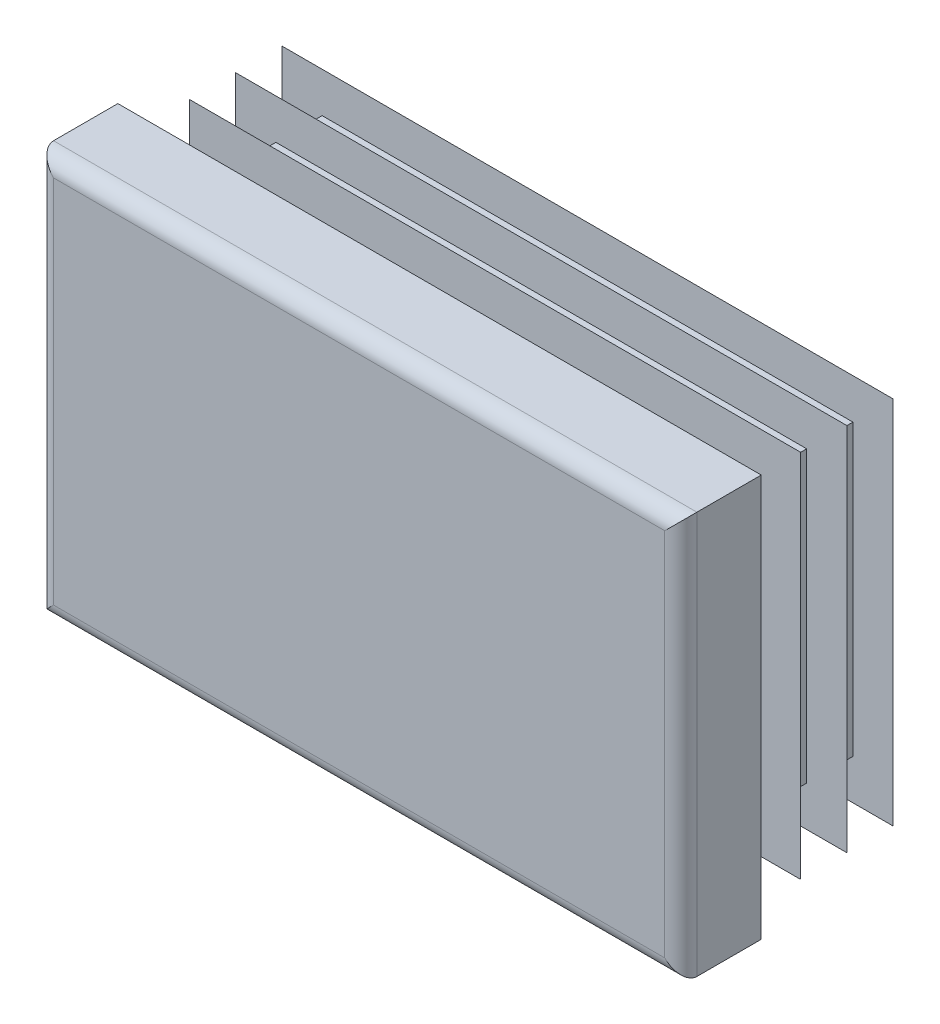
ISO-10303-21;
HEADER;
FILE_DESCRIPTION(('STEP AP214'),'2;1');
FILE_NAME('part.step','',(''),(''),'','','');
FILE_SCHEMA(('AUTOMOTIVE_DESIGN { 1 0 10303 214 1 1 1 1 }'));
ENDSEC;
DATA;
#1=APPLICATION_CONTEXT('core data for automotive mechanical design processes');
#2=APPLICATION_PROTOCOL_DEFINITION('international standard','automotive_design',2000,#1);
#3=PRODUCT_CONTEXT('',#1,'mechanical');
#4=PRODUCT('Part','Part','',(#3));
#5=PRODUCT_RELATED_PRODUCT_CATEGORY('part','',(#4));
#6=PRODUCT_DEFINITION_FORMATION('','',#4);
#7=PRODUCT_DEFINITION_CONTEXT('part definition',#1,'design');
#8=PRODUCT_DEFINITION('design','',#6,#7);
#9=PRODUCT_DEFINITION_SHAPE('','',#8);
#10=(LENGTH_UNIT() NAMED_UNIT(*) SI_UNIT(.MILLI.,.METRE.));
#11=(NAMED_UNIT(*) PLANE_ANGLE_UNIT() SI_UNIT($,.RADIAN.));
#12=(NAMED_UNIT(*) SI_UNIT($,.STERADIAN.) SOLID_ANGLE_UNIT());
#13=UNCERTAINTY_MEASURE_WITH_UNIT(LENGTH_MEASURE(1.E-05),#10,'distance_accuracy_value','');
#14=(GEOMETRIC_REPRESENTATION_CONTEXT(3) GLOBAL_UNCERTAINTY_ASSIGNED_CONTEXT((#13)) GLOBAL_UNIT_ASSIGNED_CONTEXT((#10,
#11,#12)) REPRESENTATION_CONTEXT('',''));
#15=CARTESIAN_POINT('',(0.,0.,0.));
#16=DIRECTION('',(0.,0.,1.));
#17=DIRECTION('',(1.,0.,0.));
#18=AXIS2_PLACEMENT_3D('',#15,#16,#17);
#19=CARTESIAN_POINT('',(19.,-12.5,5.));
#20=DIRECTION('',(0.,0.,-1.));
#21=DIRECTION('',(0.,1.,0.));
#22=AXIS2_PLACEMENT_3D('',#19,#20,#21);
#23=PLANE('',#22);
#24=DIRECTION('',(0.,1.,0.));
#25=VECTOR('',#24,1.);
#26=CARTESIAN_POINT('',(-19.,-12.5,5.));
#27=LINE('',#26,#25);
#28=CARTESIAN_POINT('',(-19.,-11.5,5.));
#29=VERTEX_POINT('',#28);
#30=CARTESIAN_POINT('',(-19.,11.5,5.));
#31=VERTEX_POINT('',#30);
#32=EDGE_CURVE('E310',#29,#31,#27,.T.);
#33=ORIENTED_EDGE('',*,*,#32,.F.);
#34=DIRECTION('',(-1.,0.,0.));
#35=VECTOR('',#34,1.);
#36=CARTESIAN_POINT('',(20.,-11.5,5.));
#37=LINE('',#36,#35);
#38=CARTESIAN_POINT('',(19.,-11.5,5.));
#39=VERTEX_POINT('',#38);
#40=EDGE_CURVE('E482',#39,#29,#37,.T.);
#41=ORIENTED_EDGE('',*,*,#40,.F.);
#42=DIRECTION('',(0.,1.,0.));
#43=VECTOR('',#42,1.);
#44=CARTESIAN_POINT('',(19.,-12.5,5.));
#45=LINE('',#44,#43);
#46=CARTESIAN_POINT('',(19.,11.5,5.));
#47=VERTEX_POINT('',#46);
#48=EDGE_CURVE('E305',#39,#47,#45,.T.);
#49=ORIENTED_EDGE('',*,*,#48,.T.);
#50=DIRECTION('',(-1.,0.,0.));
#51=VECTOR('',#50,1.);
#52=CARTESIAN_POINT('',(20.,11.5,5.));
#53=LINE('',#52,#51);
#54=EDGE_CURVE('E630',#47,#31,#53,.T.);
#55=ORIENTED_EDGE('',*,*,#54,.T.);
#56=EDGE_LOOP('',(#33,#41,#49,#55));
#57=FACE_BOUND('',#56,.T.);
#58=ADVANCED_FACE('F14',(#57),#23,.F.);
#59=CARTESIAN_POINT('',(-19.,-12.5,4.));
#60=DIRECTION('',(0.,1.,0.));
#61=DIRECTION('',(-1.,0.,0.));
#62=AXIS2_PLACEMENT_3D('',#59,#60,#61);
#63=CYLINDRICAL_SURFACE('',#62,1.);
#64=DIRECTION('',(0.,1.,0.));
#65=VECTOR('',#64,1.);
#66=CARTESIAN_POINT('',(-20.,-12.5,4.));
#67=LINE('',#66,#65);
#68=CARTESIAN_POINT('',(-20.,-12.5,4.));
#69=VERTEX_POINT('',#68);
#70=CARTESIAN_POINT('',(-20.,12.5,4.));
#71=VERTEX_POINT('',#70);
#72=EDGE_CURVE('E402',#69,#71,#67,.T.);
#73=ORIENTED_EDGE('',*,*,#72,.F.);
#74=CARTESIAN_POINT('',(-19.,-11.5,4.));
#75=DIRECTION('',(-0.707106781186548,0.707106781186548,0.));
#76=DIRECTION('',(0.707106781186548,0.707106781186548,0.));
#77=AXIS2_PLACEMENT_3D('',#74,#75,#76);
#78=ELLIPSE('',#77,1.41421356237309,1.);
#79=EDGE_CURVE('E59',#69,#29,#78,.T.);
#80=ORIENTED_EDGE('',*,*,#79,.T.);
#81=ORIENTED_EDGE('',*,*,#32,.T.);
#82=CARTESIAN_POINT('',(-19.,11.5,4.));
#83=DIRECTION('',(0.707106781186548,0.707106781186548,0.));
#84=DIRECTION('',(-0.707106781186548,0.707106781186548,0.));
#85=AXIS2_PLACEMENT_3D('',#82,#83,#84);
#86=ELLIPSE('',#85,1.4142135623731,1.);
#87=EDGE_CURVE('E306',#31,#71,#86,.F.);
#88=ORIENTED_EDGE('',*,*,#87,.T.);
#89=EDGE_LOOP('',(#73,#80,#81,#88));
#90=FACE_BOUND('',#89,.T.);
#91=ADVANCED_FACE('F16',(#90),#63,.T.);
#92=CARTESIAN_POINT('',(-20.,-12.5,4.));
#93=DIRECTION('',(1.,0.,0.));
#94=DIRECTION('',(0.,1.,0.));
#95=AXIS2_PLACEMENT_3D('',#92,#93,#94);
#96=PLANE('',#95);
#97=DIRECTION('',(0.,0.,-1.));
#98=VECTOR('',#97,1.);
#99=CARTESIAN_POINT('',(-20.,12.5,4.));
#100=LINE('',#99,#98);
#101=CARTESIAN_POINT('',(-20.,12.5,0.));
#102=VERTEX_POINT('',#101);
#103=EDGE_CURVE('E615',#71,#102,#100,.T.);
#104=ORIENTED_EDGE('',*,*,#103,.T.);
#105=DIRECTION('',(0.,1.,0.));
#106=VECTOR('',#105,1.);
#107=CARTESIAN_POINT('',(-20.,-12.5,0.));
#108=LINE('',#107,#106);
#109=CARTESIAN_POINT('',(-20.,-12.5,0.));
#110=VERTEX_POINT('',#109);
#111=EDGE_CURVE('E400',#110,#102,#108,.T.);
#112=ORIENTED_EDGE('',*,*,#111,.F.);
#113=DIRECTION('',(0.,0.,-1.));
#114=VECTOR('',#113,1.);
#115=CARTESIAN_POINT('',(-20.,-12.5,4.));
#116=LINE('',#115,#114);
#117=EDGE_CURVE('E616',#69,#110,#116,.T.);
#118=ORIENTED_EDGE('',*,*,#117,.F.);
#119=ORIENTED_EDGE('',*,*,#72,.T.);
#120=EDGE_LOOP('',(#104,#112,#118,#119));
#121=FACE_BOUND('',#120,.T.);
#122=ADVANCED_FACE('F697',(#121),#96,.F.);
#123=CARTESIAN_POINT('',(-16.5,-12.5,0.));
#124=DIRECTION('',(1.,0.,0.));
#125=DIRECTION('',(0.,1.,0.));
#126=AXIS2_PLACEMENT_3D('',#123,#124,#125);
#127=PLANE('',#126);
#128=DIRECTION('',(0.,1.,0.));
#129=VECTOR('',#128,1.);
#130=CARTESIAN_POINT('',(-16.5,-12.5,0.));
#131=LINE('',#130,#129);
#132=CARTESIAN_POINT('',(-16.5,-9.,0.));
#133=VERTEX_POINT('',#132);
#134=CARTESIAN_POINT('',(-16.5,9.,0.));
#135=VERTEX_POINT('',#134);
#136=EDGE_CURVE('E397',#133,#135,#131,.T.);
#137=ORIENTED_EDGE('',*,*,#136,.T.);
#138=DIRECTION('',(0.,0.,-1.));
#139=VECTOR('',#138,1.);
#140=CARTESIAN_POINT('',(-16.5,9.,0.));
#141=LINE('',#140,#139);
#142=CARTESIAN_POINT('',(-16.5,9.,-0.575));
#143=VERTEX_POINT('',#142);
#144=EDGE_CURVE('E495',#135,#143,#141,.T.);
#145=ORIENTED_EDGE('',*,*,#144,.T.);
#146=DIRECTION('',(0.,1.,0.));
#147=VECTOR('',#146,1.);
#148=CARTESIAN_POINT('',(-16.5,-12.5,-0.575));
#149=LINE('',#148,#147);
#150=CARTESIAN_POINT('',(-16.5,-9.,-0.575));
#151=VERTEX_POINT('',#150);
#152=EDGE_CURVE('E394',#151,#143,#149,.T.);
#153=ORIENTED_EDGE('',*,*,#152,.F.);
#154=DIRECTION('',(0.,0.,1.));
#155=VECTOR('',#154,1.);
#156=CARTESIAN_POINT('',(-16.5,-9.,0.));
#157=LINE('',#156,#155);
#158=EDGE_CURVE('E489',#151,#133,#157,.T.);
#159=ORIENTED_EDGE('',*,*,#158,.T.);
#160=EDGE_LOOP('',(#137,#145,#153,#159));
#161=FACE_BOUND('',#160,.T.);
#162=ADVANCED_FACE('F787',(#161),#127,.F.);
#163=CARTESIAN_POINT('',(-19.,-12.5,-0.575));
#164=DIRECTION('',(0.342020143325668,0.,0.939692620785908));
#165=DIRECTION('',(-0.939692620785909,0.,0.342020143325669));
#166=AXIS2_PLACEMENT_3D('',#163,#164,#165);
#167=PLANE('',#166);
#168=DIRECTION('',(0.,1.,0.));
#169=VECTOR('',#168,1.);
#170=CARTESIAN_POINT('',(-19.,-12.5,-0.575));
#171=LINE('',#170,#169);
#172=CARTESIAN_POINT('',(-19.,-11.5,-0.575));
#173=VERTEX_POINT('',#172);
#174=CARTESIAN_POINT('',(-19.,11.5,-0.575));
#175=VERTEX_POINT('',#174);
#176=EDGE_CURVE('E392',#173,#175,#171,.T.);
#177=ORIENTED_EDGE('',*,*,#176,.T.);
#178=DIRECTION('',(0.844349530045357,-0.438895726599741,-0.307318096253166));
#179=VECTOR('',#178,1.);
#180=CARTESIAN_POINT('',(-10.1060463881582,6.87689298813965,-3.81213437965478));
#181=LINE('',#180,#179);
#182=CARTESIAN_POINT('',(-16.5,10.2004915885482,-1.48492558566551));
#183=VERTEX_POINT('',#182);
#184=EDGE_CURVE('E519',#175,#183,#181,.T.);
#185=ORIENTED_EDGE('',*,*,#184,.T.);
#186=DIRECTION('',(0.,1.,0.));
#187=VECTOR('',#186,1.);
#188=CARTESIAN_POINT('',(-16.5,-12.5,-1.48492558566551));
#189=LINE('',#188,#187);
#190=CARTESIAN_POINT('',(-16.5,-10.2004915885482,-1.48492558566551));
#191=VERTEX_POINT('',#190);
#192=EDGE_CURVE('E389',#191,#183,#189,.T.);
#193=ORIENTED_EDGE('',*,*,#192,.F.);
#194=DIRECTION('',(-0.844349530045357,-0.43889572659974,0.307318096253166));
#195=VECTOR('',#194,1.);
#196=CARTESIAN_POINT('',(-19.3705814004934,-11.6926294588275,-0.440119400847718));
#197=LINE('',#196,#195);
#198=EDGE_CURVE('E507',#191,#173,#197,.T.);
#199=ORIENTED_EDGE('',*,*,#198,.T.);
#200=EDGE_LOOP('',(#177,#185,#193,#199));
#201=FACE_BOUND('',#200,.T.);
#202=ADVANCED_FACE('F783',(#201),#167,.F.);
#203=CARTESIAN_POINT('',(-16.5,-12.5,-1.48492558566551));
#204=DIRECTION('',(1.,0.,0.));
#205=DIRECTION('',(0.,1.,0.));
#206=AXIS2_PLACEMENT_3D('',#203,#204,#205);
#207=PLANE('',#206);
#208=ORIENTED_EDGE('',*,*,#192,.T.);
#209=DIRECTION('',(0.,-0.819152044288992,-0.573576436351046));
#210=VECTOR('',#209,1.);
#211=CARTESIAN_POINT('',(-16.5,-5.03176689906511,-12.1506678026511));
#212=LINE('',#211,#210);
#213=CARTESIAN_POINT('',(-16.5,9.,-2.32551884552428));
#214=VERTEX_POINT('',#213);
#215=EDGE_CURVE('E516',#183,#214,#212,.T.);
#216=ORIENTED_EDGE('',*,*,#215,.T.);
#217=DIRECTION('',(0.,0.,-1.));
#218=VECTOR('',#217,1.);
#219=CARTESIAN_POINT('',(-16.5,9.,-1.48492558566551));
#220=LINE('',#219,#218);
#221=CARTESIAN_POINT('',(-16.5,9.,-3.45));
#222=VERTEX_POINT('',#221);
#223=EDGE_CURVE('E525',#214,#222,#220,.T.);
#224=ORIENTED_EDGE('',*,*,#223,.T.);
#225=DIRECTION('',(0.,1.,0.));
#226=VECTOR('',#225,1.);
#227=CARTESIAN_POINT('',(-16.5,-12.5,-3.45));
#228=LINE('',#227,#226);
#229=CARTESIAN_POINT('',(-16.5,-9.,-3.45));
#230=VERTEX_POINT('',#229);
#231=EDGE_CURVE('E386',#230,#222,#228,.T.);
#232=ORIENTED_EDGE('',*,*,#231,.F.);
#233=DIRECTION('',(0.,0.,1.));
#234=VECTOR('',#233,1.);
#235=CARTESIAN_POINT('',(-16.5,-9.,-1.48492558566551));
#236=LINE('',#235,#234);
#237=CARTESIAN_POINT('',(-16.5,-9.,-2.32551884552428));
#238=VERTEX_POINT('',#237);
#239=EDGE_CURVE('E522',#230,#238,#236,.T.);
#240=ORIENTED_EDGE('',*,*,#239,.T.);
#241=DIRECTION('',(0.,-0.819152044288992,0.573576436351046));
#242=VECTOR('',#241,1.);
#243=CARTESIAN_POINT('',(-16.5,-11.7434848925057,-0.404510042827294));
#244=LINE('',#243,#242);
#245=EDGE_CURVE('E504',#238,#191,#244,.T.);
#246=ORIENTED_EDGE('',*,*,#245,.T.);
#247=EDGE_LOOP('',(#208,#216,#224,#232,#240,#246));
#248=FACE_BOUND('',#247,.T.);
#249=ADVANCED_FACE('F779',(#248),#207,.F.);
#250=CARTESIAN_POINT('',(-19.,-12.5,-3.45));
#251=DIRECTION('',(0.342020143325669,0.,0.939692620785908));
#252=DIRECTION('',(-0.939692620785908,0.,0.342020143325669));
#253=AXIS2_PLACEMENT_3D('',#250,#251,#252);
#254=PLANE('',#253);
#255=DIRECTION('',(0.,1.,0.));
#256=VECTOR('',#255,1.);
#257=CARTESIAN_POINT('',(-19.,-12.5,-3.45));
#258=LINE('',#257,#256);
#259=CARTESIAN_POINT('',(-19.,-11.5,-3.45));
#260=VERTEX_POINT('',#259);
#261=CARTESIAN_POINT('',(-19.,11.5,-3.45));
#262=VERTEX_POINT('',#261);
#263=EDGE_CURVE('E384',#260,#262,#258,.T.);
#264=ORIENTED_EDGE('',*,*,#263,.T.);
#265=DIRECTION('',(0.844349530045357,-0.438895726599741,-0.307318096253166));
#266=VECTOR('',#265,1.);
#267=CARTESIAN_POINT('',(-10.1060463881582,6.87689298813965,-6.68713437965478));
#268=LINE('',#267,#266);
#269=CARTESIAN_POINT('',(-16.5,10.2004915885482,-4.35992558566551));
#270=VERTEX_POINT('',#269);
#271=EDGE_CURVE('E549',#262,#270,#268,.T.);
#272=ORIENTED_EDGE('',*,*,#271,.T.);
#273=DIRECTION('',(0.,1.,0.));
#274=VECTOR('',#273,1.);
#275=CARTESIAN_POINT('',(-16.5,-12.5,-4.35992558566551));
#276=LINE('',#275,#274);
#277=CARTESIAN_POINT('',(-16.5,-10.2004915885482,-4.35992558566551));
#278=VERTEX_POINT('',#277);
#279=EDGE_CURVE('E381',#278,#270,#276,.T.);
#280=ORIENTED_EDGE('',*,*,#279,.F.);
#281=DIRECTION('',(-0.844349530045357,-0.43889572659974,0.307318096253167));
#282=VECTOR('',#281,1.);
#283=CARTESIAN_POINT('',(-19.3705814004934,-11.6926294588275,-3.31511940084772));
#284=LINE('',#283,#282);
#285=EDGE_CURVE('E537',#278,#260,#284,.T.);
#286=ORIENTED_EDGE('',*,*,#285,.T.);
#287=EDGE_LOOP('',(#264,#272,#280,#286));
#288=FACE_BOUND('',#287,.T.);
#289=ADVANCED_FACE('F775',(#288),#254,.F.);
#290=CARTESIAN_POINT('',(-16.5,-12.5,-4.35992558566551));
#291=DIRECTION('',(1.,0.,0.));
#292=DIRECTION('',(0.,1.,0.));
#293=AXIS2_PLACEMENT_3D('',#290,#291,#292);
#294=PLANE('',#293);
#295=ORIENTED_EDGE('',*,*,#279,.T.);
#296=DIRECTION('',(0.,-0.819152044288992,-0.573576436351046));
#297=VECTOR('',#296,1.);
#298=CARTESIAN_POINT('',(-16.5,-5.03176689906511,-15.0256678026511));
#299=LINE('',#298,#297);
#300=CARTESIAN_POINT('',(-16.5,9.,-5.20051884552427));
#301=VERTEX_POINT('',#300);
#302=EDGE_CURVE('E546',#270,#301,#299,.T.);
#303=ORIENTED_EDGE('',*,*,#302,.T.);
#304=DIRECTION('',(0.,0.,-1.));
#305=VECTOR('',#304,1.);
#306=CARTESIAN_POINT('',(-16.5,9.,-4.35992558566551));
#307=LINE('',#306,#305);
#308=CARTESIAN_POINT('',(-16.5,9.,-6.325));
#309=VERTEX_POINT('',#308);
#310=EDGE_CURVE('E555',#301,#309,#307,.T.);
#311=ORIENTED_EDGE('',*,*,#310,.T.);
#312=DIRECTION('',(0.,1.,0.));
#313=VECTOR('',#312,1.);
#314=CARTESIAN_POINT('',(-16.5,-12.5,-6.325));
#315=LINE('',#314,#313);
#316=CARTESIAN_POINT('',(-16.5,-9.,-6.325));
#317=VERTEX_POINT('',#316);
#318=EDGE_CURVE('E378',#317,#309,#315,.T.);
#319=ORIENTED_EDGE('',*,*,#318,.F.);
#320=DIRECTION('',(0.,0.,1.));
#321=VECTOR('',#320,1.);
#322=CARTESIAN_POINT('',(-16.5,-9.,-4.35992558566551));
#323=LINE('',#322,#321);
#324=CARTESIAN_POINT('',(-16.5,-9.,-5.20051884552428));
#325=VERTEX_POINT('',#324);
#326=EDGE_CURVE('E552',#317,#325,#323,.T.);
#327=ORIENTED_EDGE('',*,*,#326,.T.);
#328=DIRECTION('',(0.,-0.819152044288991,0.573576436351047));
#329=VECTOR('',#328,1.);
#330=CARTESIAN_POINT('',(-16.5,-11.7434848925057,-3.27951004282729));
#331=LINE('',#330,#329);
#332=EDGE_CURVE('E534',#325,#278,#331,.T.);
#333=ORIENTED_EDGE('',*,*,#332,.T.);
#334=EDGE_LOOP('',(#295,#303,#311,#319,#327,#333));
#335=FACE_BOUND('',#334,.T.);
#336=ADVANCED_FACE('F771',(#335),#294,.F.);
#337=CARTESIAN_POINT('',(-19.,-12.5,-6.325));
#338=DIRECTION('',(0.34202014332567,0.,0.939692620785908));
#339=DIRECTION('',(-0.939692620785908,0.,0.34202014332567));
#340=AXIS2_PLACEMENT_3D('',#337,#338,#339);
#341=PLANE('',#340);
#342=DIRECTION('',(0.,1.,0.));
#343=VECTOR('',#342,1.);
#344=CARTESIAN_POINT('',(-19.,-12.5,-6.325));
#345=LINE('',#344,#343);
#346=CARTESIAN_POINT('',(-19.,-11.5,-6.325));
#347=VERTEX_POINT('',#346);
#348=CARTESIAN_POINT('',(-19.,11.5,-6.325));
#349=VERTEX_POINT('',#348);
#350=EDGE_CURVE('E376',#347,#349,#345,.T.);
#351=ORIENTED_EDGE('',*,*,#350,.T.);
#352=DIRECTION('',(0.844349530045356,-0.438895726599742,-0.307318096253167));
#353=VECTOR('',#352,1.);
#354=CARTESIAN_POINT('',(-10.1060463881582,6.87689298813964,-9.5621343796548));
#355=LINE('',#354,#353);
#356=CARTESIAN_POINT('',(-16.5,10.2004915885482,-7.23492558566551));
#357=VERTEX_POINT('',#356);
#358=EDGE_CURVE('E579',#349,#357,#355,.T.);
#359=ORIENTED_EDGE('',*,*,#358,.T.);
#360=DIRECTION('',(0.,1.,0.));
#361=VECTOR('',#360,1.);
#362=CARTESIAN_POINT('',(-16.5,-12.5,-7.23492558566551));
#363=LINE('',#362,#361);
#364=CARTESIAN_POINT('',(-16.5,-10.2004915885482,-7.23492558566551));
#365=VERTEX_POINT('',#364);
#366=EDGE_CURVE('E373',#365,#357,#363,.T.);
#367=ORIENTED_EDGE('',*,*,#366,.F.);
#368=DIRECTION('',(-0.844349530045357,-0.43889572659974,0.307318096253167));
#369=VECTOR('',#368,1.);
#370=CARTESIAN_POINT('',(-19.3705814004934,-11.6926294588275,-6.19011940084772));
#371=LINE('',#370,#369);
#372=EDGE_CURVE('E567',#365,#347,#371,.T.);
#373=ORIENTED_EDGE('',*,*,#372,.T.);
#374=EDGE_LOOP('',(#351,#359,#367,#373));
#375=FACE_BOUND('',#374,.T.);
#376=ADVANCED_FACE('F767',(#375),#341,.F.);
#377=CARTESIAN_POINT('',(-16.5,-12.5,-7.23492558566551));
#378=DIRECTION('',(1.,0.,0.));
#379=DIRECTION('',(0.,1.,0.));
#380=AXIS2_PLACEMENT_3D('',#377,#378,#379);
#381=PLANE('',#380);
#382=ORIENTED_EDGE('',*,*,#366,.T.);
#383=DIRECTION('',(0.,-0.819152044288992,-0.573576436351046));
#384=VECTOR('',#383,1.);
#385=CARTESIAN_POINT('',(-16.5,-5.03176689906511,-17.9006678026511));
#386=LINE('',#385,#384);
#387=CARTESIAN_POINT('',(-16.5,9.,-8.07551884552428));
#388=VERTEX_POINT('',#387);
#389=EDGE_CURVE('E576',#357,#388,#386,.T.);
#390=ORIENTED_EDGE('',*,*,#389,.T.);
#391=DIRECTION('',(0.,0.,-1.));
#392=VECTOR('',#391,1.);
#393=CARTESIAN_POINT('',(-16.5,9.,-7.23492558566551));
#394=LINE('',#393,#392);
#395=CARTESIAN_POINT('',(-16.5,9.,-9.2));
#396=VERTEX_POINT('',#395);
#397=EDGE_CURVE('E585',#388,#396,#394,.T.);
#398=ORIENTED_EDGE('',*,*,#397,.T.);
#399=DIRECTION('',(0.,1.,0.));
#400=VECTOR('',#399,1.);
#401=CARTESIAN_POINT('',(-16.5,-12.5,-9.2));
#402=LINE('',#401,#400);
#403=CARTESIAN_POINT('',(-16.5,-9.,-9.2));
#404=VERTEX_POINT('',#403);
#405=EDGE_CURVE('E370',#404,#396,#402,.T.);
#406=ORIENTED_EDGE('',*,*,#405,.F.);
#407=DIRECTION('',(0.,0.,1.));
#408=VECTOR('',#407,1.);
#409=CARTESIAN_POINT('',(-16.5,-9.,-7.23492558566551));
#410=LINE('',#409,#408);
#411=CARTESIAN_POINT('',(-16.5,-9.,-8.07551884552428));
#412=VERTEX_POINT('',#411);
#413=EDGE_CURVE('E582',#404,#412,#410,.T.);
#414=ORIENTED_EDGE('',*,*,#413,.T.);
#415=DIRECTION('',(0.,-0.819152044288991,0.573576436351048));
#416=VECTOR('',#415,1.);
#417=CARTESIAN_POINT('',(-16.5,-11.7434848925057,-6.1545100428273));
#418=LINE('',#417,#416);
#419=EDGE_CURVE('E564',#412,#365,#418,.T.);
#420=ORIENTED_EDGE('',*,*,#419,.T.);
#421=EDGE_LOOP('',(#382,#390,#398,#406,#414,#420));
#422=FACE_BOUND('',#421,.T.);
#423=ADVANCED_FACE('F764',(#422),#381,.F.);
#424=CARTESIAN_POINT('',(-19.,-12.5,-9.2));
#425=DIRECTION('',(0.342020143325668,0.,0.939692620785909));
#426=DIRECTION('',(-0.939692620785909,0.,0.342020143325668));
#427=AXIS2_PLACEMENT_3D('',#424,#425,#426);
#428=PLANE('',#427);
#429=DIRECTION('',(0.,1.,0.));
#430=VECTOR('',#429,1.);
#431=CARTESIAN_POINT('',(-19.,-12.5,-9.2));
#432=LINE('',#431,#430);
#433=CARTESIAN_POINT('',(-19.,-11.5,-9.2));
#434=VERTEX_POINT('',#433);
#435=CARTESIAN_POINT('',(-19.,11.5,-9.2));
#436=VERTEX_POINT('',#435);
#437=EDGE_CURVE('E368',#434,#436,#432,.T.);
#438=ORIENTED_EDGE('',*,*,#437,.T.);
#439=DIRECTION('',(0.844349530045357,-0.43889572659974,-0.307318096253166));
#440=VECTOR('',#439,1.);
#441=CARTESIAN_POINT('',(-10.1060463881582,6.87689298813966,-12.4371343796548));
#442=LINE('',#441,#440);
#443=CARTESIAN_POINT('',(-16.5,10.2004915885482,-10.1099255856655));
#444=VERTEX_POINT('',#443);
#445=EDGE_CURVE('E607',#436,#444,#442,.T.);
#446=ORIENTED_EDGE('',*,*,#445,.T.);
#447=DIRECTION('',(0.,1.,0.));
#448=VECTOR('',#447,1.);
#449=CARTESIAN_POINT('',(-16.5,-12.5,-10.1099255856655));
#450=LINE('',#449,#448);
#451=CARTESIAN_POINT('',(-16.5,-10.2004915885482,-10.1099255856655));
#452=VERTEX_POINT('',#451);
#453=EDGE_CURVE('E365',#452,#444,#450,.T.);
#454=ORIENTED_EDGE('',*,*,#453,.F.);
#455=DIRECTION('',(-0.844349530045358,-0.43889572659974,0.307318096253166));
#456=VECTOR('',#455,1.);
#457=CARTESIAN_POINT('',(-19.3705814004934,-11.6926294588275,-9.06511940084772));
#458=LINE('',#457,#456);
#459=EDGE_CURVE('E595',#452,#434,#458,.T.);
#460=ORIENTED_EDGE('',*,*,#459,.T.);
#461=EDGE_LOOP('',(#438,#446,#454,#460));
#462=FACE_BOUND('',#461,.T.);
#463=ADVANCED_FACE('F675',(#462),#428,.F.);
#464=CARTESIAN_POINT('',(-16.5,-12.5,-10.1099255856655));
#465=DIRECTION('',(1.,0.,0.));
#466=DIRECTION('',(0.,1.,0.));
#467=AXIS2_PLACEMENT_3D('',#464,#465,#466);
#468=PLANE('',#467);
#469=ORIENTED_EDGE('',*,*,#453,.T.);
#470=DIRECTION('',(0.,-0.819152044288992,-0.573576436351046));
#471=VECTOR('',#470,1.);
#472=CARTESIAN_POINT('',(-16.5,-5.03176689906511,-20.7756678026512));
#473=LINE('',#472,#471);
#474=CARTESIAN_POINT('',(-16.5,9.,-10.9505188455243));
#475=VERTEX_POINT('',#474);
#476=EDGE_CURVE('E604',#444,#475,#473,.T.);
#477=ORIENTED_EDGE('',*,*,#476,.T.);
#478=DIRECTION('',(0.,0.,-1.));
#479=VECTOR('',#478,1.);
#480=CARTESIAN_POINT('',(-16.5,9.,-10.1099255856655));
#481=LINE('',#480,#479);
#482=CARTESIAN_POINT('',(-16.5,9.,-11.5));
#483=VERTEX_POINT('',#482);
#484=EDGE_CURVE('E613',#475,#483,#481,.T.);
#485=ORIENTED_EDGE('',*,*,#484,.T.);
#486=DIRECTION('',(0.,1.,0.));
#487=VECTOR('',#486,1.);
#488=CARTESIAN_POINT('',(-16.5,-12.5,-11.5));
#489=LINE('',#488,#487);
#490=CARTESIAN_POINT('',(-16.5,-9.,-11.5));
#491=VERTEX_POINT('',#490);
#492=EDGE_CURVE('E362',#491,#483,#489,.T.);
#493=ORIENTED_EDGE('',*,*,#492,.F.);
#494=DIRECTION('',(0.,0.,1.));
#495=VECTOR('',#494,1.);
#496=CARTESIAN_POINT('',(-16.5,-9.,-10.1099255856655));
#497=LINE('',#496,#495);
#498=CARTESIAN_POINT('',(-16.5,-9.,-10.9505188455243));
#499=VERTEX_POINT('',#498);
#500=EDGE_CURVE('E610',#491,#499,#497,.T.);
#501=ORIENTED_EDGE('',*,*,#500,.T.);
#502=DIRECTION('',(0.,-0.819152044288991,0.573576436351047));
#503=VECTOR('',#502,1.);
#504=CARTESIAN_POINT('',(-16.5,-11.7434848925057,-9.02951004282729));
#505=LINE('',#504,#503);
#506=EDGE_CURVE('E592',#499,#452,#505,.T.);
#507=ORIENTED_EDGE('',*,*,#506,.T.);
#508=EDGE_LOOP('',(#469,#477,#485,#493,#501,#507));
#509=FACE_BOUND('',#508,.T.);
#510=ADVANCED_FACE('F677',(#509),#468,.F.);
#511=CARTESIAN_POINT('',(-16.5,-12.5,-11.5));
#512=DIRECTION('',(0.,0.,1.));
#513=DIRECTION('',(0.,-1.,0.));
#514=AXIS2_PLACEMENT_3D('',#511,#512,#513);
#515=PLANE('',#514);
#516=ORIENTED_EDGE('',*,*,#492,.T.);
#517=DIRECTION('',(-1.,0.,0.));
#518=VECTOR('',#517,1.);
#519=CARTESIAN_POINT('',(20.,9.,-11.5));
#520=LINE('',#519,#518);
#521=CARTESIAN_POINT('',(16.5,9.,-11.5));
#522=VERTEX_POINT('',#521);
#523=EDGE_CURVE('E438',#522,#483,#520,.T.);
#524=ORIENTED_EDGE('',*,*,#523,.F.);
#525=DIRECTION('',(0.,1.,0.));
#526=VECTOR('',#525,1.);
#527=CARTESIAN_POINT('',(16.5,-12.5,-11.5));
#528=LINE('',#527,#526);
#529=CARTESIAN_POINT('',(16.5,-9.,-11.5));
#530=VERTEX_POINT('',#529);
#531=EDGE_CURVE('E359',#530,#522,#528,.T.);
#532=ORIENTED_EDGE('',*,*,#531,.F.);
#533=DIRECTION('',(-1.,0.,0.));
#534=VECTOR('',#533,1.);
#535=CARTESIAN_POINT('',(20.,-9.,-11.5));
#536=LINE('',#535,#534);
#537=EDGE_CURVE('E436',#530,#491,#536,.T.);
#538=ORIENTED_EDGE('',*,*,#537,.T.);
#539=EDGE_LOOP('',(#516,#524,#532,#538));
#540=FACE_BOUND('',#539,.T.);
#541=ADVANCED_FACE('F435',(#540),#515,.F.);
#542=CARTESIAN_POINT('',(16.5,-12.5,-11.5));
#543=DIRECTION('',(-1.,0.,0.));
#544=DIRECTION('',(0.,-1.,0.));
#545=AXIS2_PLACEMENT_3D('',#542,#543,#544);
#546=PLANE('',#545);
#547=DIRECTION('',(0.,0.,1.));
#548=VECTOR('',#547,1.);
#549=CARTESIAN_POINT('',(16.5,9.,-11.5));
#550=LINE('',#549,#548);
#551=CARTESIAN_POINT('',(16.5,9.,-10.9505188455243));
#552=VERTEX_POINT('',#551);
#553=EDGE_CURVE('E9',#522,#552,#550,.T.);
#554=ORIENTED_EDGE('',*,*,#553,.T.);
#555=DIRECTION('',(0.,0.819152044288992,0.573576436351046));
#556=VECTOR('',#555,1.);
#557=CARTESIAN_POINT('',(16.5,-5.68488823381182,-21.2329882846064));
#558=LINE('',#557,#556);
#559=CARTESIAN_POINT('',(16.5,10.2004915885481,-10.1099255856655));
#560=VERTEX_POINT('',#559);
#561=EDGE_CURVE('E601',#552,#560,#558,.T.);
#562=ORIENTED_EDGE('',*,*,#561,.T.);
#563=DIRECTION('',(0.,1.,0.));
#564=VECTOR('',#563,1.);
#565=CARTESIAN_POINT('',(16.5,-12.5,-10.1099255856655));
#566=LINE('',#565,#564);
#567=CARTESIAN_POINT('',(16.5,-10.2004915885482,-10.1099255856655));
#568=VERTEX_POINT('',#567);
#569=EDGE_CURVE('E356',#568,#560,#566,.T.);
#570=ORIENTED_EDGE('',*,*,#569,.F.);
#571=DIRECTION('',(0.,0.819152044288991,-0.573576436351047));
#572=VECTOR('',#571,1.);
#573=CARTESIAN_POINT('',(16.5,-11.090363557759,-9.48683052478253));
#574=LINE('',#573,#572);
#575=CARTESIAN_POINT('',(16.5,-9.,-10.9505188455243));
#576=VERTEX_POINT('',#575);
#577=EDGE_CURVE('E428',#568,#576,#574,.T.);
#578=ORIENTED_EDGE('',*,*,#577,.T.);
#579=DIRECTION('',(0.,0.,-1.));
#580=VECTOR('',#579,1.);
#581=CARTESIAN_POINT('',(16.5,-9.,-11.5));
#582=LINE('',#581,#580);
#583=EDGE_CURVE('E23',#576,#530,#582,.T.);
#584=ORIENTED_EDGE('',*,*,#583,.T.);
#585=ORIENTED_EDGE('',*,*,#531,.T.);
#586=EDGE_LOOP('',(#554,#562,#570,#578,#584,#585));
#587=FACE_BOUND('',#586,.T.);
#588=ADVANCED_FACE('F426',(#587),#546,.F.);
#589=CARTESIAN_POINT('',(16.5,-12.5,-10.1099255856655));
#590=DIRECTION('',(-0.342020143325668,0.,0.939692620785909));
#591=DIRECTION('',(-0.939692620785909,0.,-0.342020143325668));
#592=AXIS2_PLACEMENT_3D('',#589,#590,#591);
#593=PLANE('',#592);
#594=ORIENTED_EDGE('',*,*,#569,.T.);
#595=DIRECTION('',(0.844349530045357,0.43889572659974,0.307318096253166));
#596=VECTOR('',#595,1.);
#597=CARTESIAN_POINT('',(8.08762003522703,5.82770817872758,-13.1717814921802));
#598=LINE('',#597,#596);
#599=CARTESIAN_POINT('',(19.,11.5,-9.2));
#600=VERTEX_POINT('',#599);
#601=EDGE_CURVE('E598',#560,#600,#598,.T.);
#602=ORIENTED_EDGE('',*,*,#601,.T.);
#603=DIRECTION('',(0.,1.,0.));
#604=VECTOR('',#603,1.);
#605=CARTESIAN_POINT('',(19.,-12.5,-9.2));
#606=LINE('',#605,#604);
#607=CARTESIAN_POINT('',(19.,-11.5,-9.2));
#608=VERTEX_POINT('',#607);
#609=EDGE_CURVE('E353',#608,#600,#606,.T.);
#610=ORIENTED_EDGE('',*,*,#609,.F.);
#611=DIRECTION('',(-0.844349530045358,0.43889572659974,-0.307318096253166));
#612=VECTOR('',#611,1.);
#613=CARTESIAN_POINT('',(17.3521550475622,-10.6434446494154,-9.79976651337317));
#614=LINE('',#613,#612);
#615=EDGE_CURVE('E588',#608,#568,#614,.T.);
#616=ORIENTED_EDGE('',*,*,#615,.T.);
#617=EDGE_LOOP('',(#594,#602,#610,#616));
#618=FACE_BOUND('',#617,.T.);
#619=ADVANCED_FACE('F752',(#618),#593,.F.);
#620=CARTESIAN_POINT('',(19.,-12.5,-9.2));
#621=DIRECTION('',(0.,0.,-1.));
#622=DIRECTION('',(0.,1.,0.));
#623=AXIS2_PLACEMENT_3D('',#620,#621,#622);
#624=PLANE('',#623);
#625=ORIENTED_EDGE('',*,*,#609,.T.);
#626=DIRECTION('',(-1.,0.,0.));
#627=VECTOR('',#626,1.);
#628=CARTESIAN_POINT('',(20.,11.5,-9.2));
#629=LINE('',#628,#627);
#630=EDGE_CURVE('E444',#600,#436,#629,.T.);
#631=ORIENTED_EDGE('',*,*,#630,.T.);
#632=ORIENTED_EDGE('',*,*,#437,.F.);
#633=DIRECTION('',(-1.,0.,0.));
#634=VECTOR('',#633,1.);
#635=CARTESIAN_POINT('',(20.,-11.5,-9.2));
#636=LINE('',#635,#634);
#637=EDGE_CURVE('E451',#608,#434,#636,.T.);
#638=ORIENTED_EDGE('',*,*,#637,.F.);
#639=EDGE_LOOP('',(#625,#631,#632,#638));
#640=FACE_BOUND('',#639,.T.);
#641=ORIENTED_EDGE('',*,*,#405,.T.);
#642=DIRECTION('',(-1.,0.,0.));
#643=VECTOR('',#642,1.);
#644=CARTESIAN_POINT('',(20.,9.,-9.2));
#645=LINE('',#644,#643);
#646=CARTESIAN_POINT('',(16.5,9.,-9.2));
#647=VERTEX_POINT('',#646);
#648=EDGE_CURVE('E663',#647,#396,#645,.T.);
#649=ORIENTED_EDGE('',*,*,#648,.F.);
#650=DIRECTION('',(0.,1.,0.));
#651=VECTOR('',#650,1.);
#652=CARTESIAN_POINT('',(16.5,-12.5,-9.2));
#653=LINE('',#652,#651);
#654=CARTESIAN_POINT('',(16.5,-9.,-9.2));
#655=VERTEX_POINT('',#654);
#656=EDGE_CURVE('E350',#655,#647,#653,.T.);
#657=ORIENTED_EDGE('',*,*,#656,.F.);
#658=DIRECTION('',(-1.,0.,0.));
#659=VECTOR('',#658,1.);
#660=CARTESIAN_POINT('',(20.,-9.,-9.2));
#661=LINE('',#660,#659);
#662=EDGE_CURVE('E453',#655,#404,#661,.T.);
#663=ORIENTED_EDGE('',*,*,#662,.T.);
#664=EDGE_LOOP('',(#641,#649,#657,#663));
#665=FACE_BOUND('',#664,.T.);
#666=ADVANCED_FACE('F667',(#640,#665),#624,.F.);
#667=CARTESIAN_POINT('',(16.5,-12.5,-9.2));
#668=DIRECTION('',(-1.,0.,0.));
#669=DIRECTION('',(0.,-1.,0.));
#670=AXIS2_PLACEMENT_3D('',#667,#668,#669);
#671=PLANE('',#670);
#672=DIRECTION('',(0.,0.,1.));
#673=VECTOR('',#672,1.);
#674=CARTESIAN_POINT('',(16.5,9.,-9.2));
#675=LINE('',#674,#673);
#676=CARTESIAN_POINT('',(16.5,9.,-8.07551884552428));
#677=VERTEX_POINT('',#676);
#678=EDGE_CURVE('E420',#647,#677,#675,.T.);
#679=ORIENTED_EDGE('',*,*,#678,.T.);
#680=DIRECTION('',(0.,0.819152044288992,0.573576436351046));
#681=VECTOR('',#680,1.);
#682=CARTESIAN_POINT('',(16.5,-5.95504986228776,-18.5471574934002));
#683=LINE('',#682,#681);
#684=CARTESIAN_POINT('',(16.5,10.2004915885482,-7.23492558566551));
#685=VERTEX_POINT('',#684);
#686=EDGE_CURVE('E573',#677,#685,#683,.T.);
#687=ORIENTED_EDGE('',*,*,#686,.T.);
#688=DIRECTION('',(0.,1.,0.));
#689=VECTOR('',#688,1.);
#690=CARTESIAN_POINT('',(16.5,-12.5,-7.23492558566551));
#691=LINE('',#690,#689);
#692=CARTESIAN_POINT('',(16.5,-10.2004915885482,-7.23492558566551));
#693=VERTEX_POINT('',#692);
#694=EDGE_CURVE('E347',#693,#685,#691,.T.);
#695=ORIENTED_EDGE('',*,*,#694,.F.);
#696=DIRECTION('',(0.,0.819152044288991,-0.573576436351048));
#697=VECTOR('',#696,1.);
#698=CARTESIAN_POINT('',(16.5,-10.8202019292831,-6.8009997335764));
#699=LINE('',#698,#697);
#700=CARTESIAN_POINT('',(16.5,-9.,-8.07551884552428));
#701=VERTEX_POINT('',#700);
#702=EDGE_CURVE('E561',#693,#701,#699,.T.);
#703=ORIENTED_EDGE('',*,*,#702,.T.);
#704=DIRECTION('',(0.,0.,-1.));
#705=VECTOR('',#704,1.);
#706=CARTESIAN_POINT('',(16.5,-9.,-9.2));
#707=LINE('',#706,#705);
#708=EDGE_CURVE('E417',#701,#655,#707,.T.);
#709=ORIENTED_EDGE('',*,*,#708,.T.);
#710=ORIENTED_EDGE('',*,*,#656,.T.);
#711=EDGE_LOOP('',(#679,#687,#695,#703,#709,#710));
#712=FACE_BOUND('',#711,.T.);
#713=ADVANCED_FACE('F745',(#712),#671,.F.);
#714=CARTESIAN_POINT('',(16.5,-12.5,-7.23492558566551));
#715=DIRECTION('',(-0.342020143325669,0.,0.939692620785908));
#716=DIRECTION('',(-0.939692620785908,0.,-0.342020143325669));
#717=AXIS2_PLACEMENT_3D('',#714,#715,#716);
#718=PLANE('',#717);
#719=ORIENTED_EDGE('',*,*,#694,.T.);
#720=DIRECTION('',(0.844349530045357,0.438895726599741,0.307318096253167));
#721=VECTOR('',#720,1.);
#722=CARTESIAN_POINT('',(8.08762003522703,5.82770817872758,-10.2967814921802));
#723=LINE('',#722,#721);
#724=CARTESIAN_POINT('',(19.,11.5,-6.325));
#725=VERTEX_POINT('',#724);
#726=EDGE_CURVE('E570',#685,#725,#723,.T.);
#727=ORIENTED_EDGE('',*,*,#726,.T.);
#728=DIRECTION('',(0.,1.,0.));
#729=VECTOR('',#728,1.);
#730=CARTESIAN_POINT('',(19.,-12.5,-6.325));
#731=LINE('',#730,#729);
#732=CARTESIAN_POINT('',(19.,-11.5,-6.325));
#733=VERTEX_POINT('',#732);
#734=EDGE_CURVE('E344',#733,#725,#731,.T.);
#735=ORIENTED_EDGE('',*,*,#734,.F.);
#736=DIRECTION('',(-0.844349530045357,0.43889572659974,-0.307318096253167));
#737=VECTOR('',#736,1.);
#738=CARTESIAN_POINT('',(17.3521550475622,-10.6434446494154,-6.92476651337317));
#739=LINE('',#738,#737);
#740=EDGE_CURVE('E558',#733,#693,#739,.T.);
#741=ORIENTED_EDGE('',*,*,#740,.T.);
#742=EDGE_LOOP('',(#719,#727,#735,#741));
#743=FACE_BOUND('',#742,.T.);
#744=ADVANCED_FACE('F741',(#743),#718,.F.);
#745=CARTESIAN_POINT('',(19.,-12.5,-6.325));
#746=DIRECTION('',(0.,0.,-1.));
#747=DIRECTION('',(0.,1.,0.));
#748=AXIS2_PLACEMENT_3D('',#745,#746,#747);
#749=PLANE('',#748);
#750=ORIENTED_EDGE('',*,*,#734,.T.);
#751=DIRECTION('',(-1.,0.,0.));
#752=VECTOR('',#751,1.);
#753=CARTESIAN_POINT('',(20.,11.5,-6.325));
#754=LINE('',#753,#752);
#755=EDGE_CURVE('E657',#725,#349,#754,.T.);
#756=ORIENTED_EDGE('',*,*,#755,.T.);
#757=ORIENTED_EDGE('',*,*,#350,.F.);
#758=DIRECTION('',(-1.,0.,0.));
#759=VECTOR('',#758,1.);
#760=CARTESIAN_POINT('',(20.,-11.5,-6.325));
#761=LINE('',#760,#759);
#762=EDGE_CURVE('E459',#733,#347,#761,.T.);
#763=ORIENTED_EDGE('',*,*,#762,.F.);
#764=EDGE_LOOP('',(#750,#756,#757,#763));
#765=FACE_BOUND('',#764,.T.);
#766=ORIENTED_EDGE('',*,*,#318,.T.);
#767=DIRECTION('',(-1.,0.,0.));
#768=VECTOR('',#767,1.);
#769=CARTESIAN_POINT('',(20.,9.,-6.325));
#770=LINE('',#769,#768);
#771=CARTESIAN_POINT('',(16.5,9.,-6.325));
#772=VERTEX_POINT('',#771);
#773=EDGE_CURVE('E655',#772,#309,#770,.T.);
#774=ORIENTED_EDGE('',*,*,#773,.F.);
#775=DIRECTION('',(0.,1.,0.));
#776=VECTOR('',#775,1.);
#777=CARTESIAN_POINT('',(16.5,-12.5,-6.325));
#778=LINE('',#777,#776);
#779=CARTESIAN_POINT('',(16.5,-9.,-6.325));
#780=VERTEX_POINT('',#779);
#781=EDGE_CURVE('E341',#780,#772,#778,.T.);
#782=ORIENTED_EDGE('',*,*,#781,.F.);
#783=DIRECTION('',(-1.,0.,0.));
#784=VECTOR('',#783,1.);
#785=CARTESIAN_POINT('',(20.,-9.,-6.325));
#786=LINE('',#785,#784);
#787=EDGE_CURVE('E461',#780,#317,#786,.T.);
#788=ORIENTED_EDGE('',*,*,#787,.T.);
#789=EDGE_LOOP('',(#766,#774,#782,#788));
#790=FACE_BOUND('',#789,.T.);
#791=ADVANCED_FACE('F737',(#765,#790),#749,.F.);
#792=CARTESIAN_POINT('',(16.5,-12.5,-6.325));
#793=DIRECTION('',(-1.,0.,0.));
#794=DIRECTION('',(0.,-1.,0.));
#795=AXIS2_PLACEMENT_3D('',#792,#793,#794);
#796=PLANE('',#795);
#797=DIRECTION('',(0.,0.,1.));
#798=VECTOR('',#797,1.);
#799=CARTESIAN_POINT('',(16.5,9.,-6.325));
#800=LINE('',#799,#798);
#801=CARTESIAN_POINT('',(16.5,9.,-5.20051884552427));
#802=VERTEX_POINT('',#801);
#803=EDGE_CURVE('E414',#772,#802,#800,.T.);
#804=ORIENTED_EDGE('',*,*,#803,.T.);
#805=DIRECTION('',(0.,0.819152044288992,0.573576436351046));
#806=VECTOR('',#805,1.);
#807=CARTESIAN_POINT('',(16.5,-5.95504986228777,-15.6721574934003));
#808=LINE('',#807,#806);
#809=CARTESIAN_POINT('',(16.5,10.2004915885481,-4.35992558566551));
#810=VERTEX_POINT('',#809);
#811=EDGE_CURVE('E543',#802,#810,#808,.T.);
#812=ORIENTED_EDGE('',*,*,#811,.T.);
#813=DIRECTION('',(0.,1.,0.));
#814=VECTOR('',#813,1.);
#815=CARTESIAN_POINT('',(16.5,-12.5,-4.35992558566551));
#816=LINE('',#815,#814);
#817=CARTESIAN_POINT('',(16.5,-10.2004915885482,-4.35992558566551));
#818=VERTEX_POINT('',#817);
#819=EDGE_CURVE('E338',#818,#810,#816,.T.);
#820=ORIENTED_EDGE('',*,*,#819,.F.);
#821=DIRECTION('',(0.,0.819152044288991,-0.573576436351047));
#822=VECTOR('',#821,1.);
#823=CARTESIAN_POINT('',(16.5,-10.8202019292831,-3.9259997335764));
#824=LINE('',#823,#822);
#825=CARTESIAN_POINT('',(16.5,-9.,-5.20051884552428));
#826=VERTEX_POINT('',#825);
#827=EDGE_CURVE('E531',#818,#826,#824,.T.);
#828=ORIENTED_EDGE('',*,*,#827,.T.);
#829=DIRECTION('',(0.,0.,-1.));
#830=VECTOR('',#829,1.);
#831=CARTESIAN_POINT('',(16.5,-9.,-6.325));
#832=LINE('',#831,#830);
#833=EDGE_CURVE('E411',#826,#780,#832,.T.);
#834=ORIENTED_EDGE('',*,*,#833,.T.);
#835=ORIENTED_EDGE('',*,*,#781,.T.);
#836=EDGE_LOOP('',(#804,#812,#820,#828,#834,#835));
#837=FACE_BOUND('',#836,.T.);
#838=ADVANCED_FACE('F733',(#837),#796,.F.);
#839=CARTESIAN_POINT('',(16.5,-12.5,-4.35992558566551));
#840=DIRECTION('',(-0.342020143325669,0.,0.939692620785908));
#841=DIRECTION('',(-0.939692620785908,0.,-0.342020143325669));
#842=AXIS2_PLACEMENT_3D('',#839,#840,#841);
#843=PLANE('',#842);
#844=ORIENTED_EDGE('',*,*,#819,.T.);
#845=DIRECTION('',(0.844349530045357,0.438895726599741,0.307318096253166));
#846=VECTOR('',#845,1.);
#847=CARTESIAN_POINT('',(8.08762003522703,5.82770817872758,-7.42178149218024));
#848=LINE('',#847,#846);
#849=CARTESIAN_POINT('',(19.,11.5,-3.45));
#850=VERTEX_POINT('',#849);
#851=EDGE_CURVE('E540',#810,#850,#848,.T.);
#852=ORIENTED_EDGE('',*,*,#851,.T.);
#853=DIRECTION('',(0.,1.,0.));
#854=VECTOR('',#853,1.);
#855=CARTESIAN_POINT('',(19.,-12.5,-3.45));
#856=LINE('',#855,#854);
#857=CARTESIAN_POINT('',(19.,-11.5,-3.45));
#858=VERTEX_POINT('',#857);
#859=EDGE_CURVE('E335',#858,#850,#856,.T.);
#860=ORIENTED_EDGE('',*,*,#859,.F.);
#861=DIRECTION('',(-0.844349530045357,0.43889572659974,-0.307318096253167));
#862=VECTOR('',#861,1.);
#863=CARTESIAN_POINT('',(17.3521550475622,-10.6434446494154,-4.04976651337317));
#864=LINE('',#863,#862);
#865=EDGE_CURVE('E528',#858,#818,#864,.T.);
#866=ORIENTED_EDGE('',*,*,#865,.T.);
#867=EDGE_LOOP('',(#844,#852,#860,#866));
#868=FACE_BOUND('',#867,.T.);
#869=ADVANCED_FACE('F729',(#868),#843,.F.);
#870=CARTESIAN_POINT('',(19.,-12.5,-3.45));
#871=DIRECTION('',(0.,0.,-1.));
#872=DIRECTION('',(0.,1.,0.));
#873=AXIS2_PLACEMENT_3D('',#870,#871,#872);
#874=PLANE('',#873);
#875=ORIENTED_EDGE('',*,*,#859,.T.);
#876=DIRECTION('',(-1.,0.,0.));
#877=VECTOR('',#876,1.);
#878=CARTESIAN_POINT('',(20.,11.5,-3.45));
#879=LINE('',#878,#877);
#880=EDGE_CURVE('E649',#850,#262,#879,.T.);
#881=ORIENTED_EDGE('',*,*,#880,.T.);
#882=ORIENTED_EDGE('',*,*,#263,.F.);
#883=DIRECTION('',(-1.,0.,0.));
#884=VECTOR('',#883,1.);
#885=CARTESIAN_POINT('',(20.,-11.5,-3.45));
#886=LINE('',#885,#884);
#887=EDGE_CURVE('E467',#858,#260,#886,.T.);
#888=ORIENTED_EDGE('',*,*,#887,.F.);
#889=EDGE_LOOP('',(#875,#881,#882,#888));
#890=FACE_BOUND('',#889,.T.);
#891=ORIENTED_EDGE('',*,*,#231,.T.);
#892=DIRECTION('',(-1.,0.,0.));
#893=VECTOR('',#892,1.);
#894=CARTESIAN_POINT('',(20.,9.,-3.45));
#895=LINE('',#894,#893);
#896=CARTESIAN_POINT('',(16.5,9.,-3.45));
#897=VERTEX_POINT('',#896);
#898=EDGE_CURVE('E647',#897,#222,#895,.T.);
#899=ORIENTED_EDGE('',*,*,#898,.F.);
#900=DIRECTION('',(0.,1.,0.));
#901=VECTOR('',#900,1.);
#902=CARTESIAN_POINT('',(16.5,-12.5,-3.45));
#903=LINE('',#902,#901);
#904=CARTESIAN_POINT('',(16.5,-9.,-3.45));
#905=VERTEX_POINT('',#904);
#906=EDGE_CURVE('E332',#905,#897,#903,.T.);
#907=ORIENTED_EDGE('',*,*,#906,.F.);
#908=DIRECTION('',(-1.,0.,0.));
#909=VECTOR('',#908,1.);
#910=CARTESIAN_POINT('',(20.,-9.,-3.45));
#911=LINE('',#910,#909);
#912=EDGE_CURVE('E469',#905,#230,#911,.T.);
#913=ORIENTED_EDGE('',*,*,#912,.T.);
#914=EDGE_LOOP('',(#891,#899,#907,#913));
#915=FACE_BOUND('',#914,.T.);
#916=ADVANCED_FACE('F725',(#890,#915),#874,.F.);
#917=CARTESIAN_POINT('',(16.5,-12.5,-3.45));
#918=DIRECTION('',(-1.,0.,0.));
#919=DIRECTION('',(0.,-1.,0.));
#920=AXIS2_PLACEMENT_3D('',#917,#918,#919);
#921=PLANE('',#920);
#922=DIRECTION('',(0.,0.,1.));
#923=VECTOR('',#922,1.);
#924=CARTESIAN_POINT('',(16.5,9.,-3.45));
#925=LINE('',#924,#923);
#926=CARTESIAN_POINT('',(16.5,9.,-2.32551884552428));
#927=VERTEX_POINT('',#926);
#928=EDGE_CURVE('E408',#897,#927,#925,.T.);
#929=ORIENTED_EDGE('',*,*,#928,.T.);
#930=DIRECTION('',(0.,0.819152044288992,0.573576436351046));
#931=VECTOR('',#930,1.);
#932=CARTESIAN_POINT('',(16.5,-5.95504986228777,-12.7971574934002));
#933=LINE('',#932,#931);
#934=CARTESIAN_POINT('',(16.5,10.2004915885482,-1.48492558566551));
#935=VERTEX_POINT('',#934);
#936=EDGE_CURVE('E513',#927,#935,#933,.T.);
#937=ORIENTED_EDGE('',*,*,#936,.T.);
#938=DIRECTION('',(0.,1.,0.));
#939=VECTOR('',#938,1.);
#940=CARTESIAN_POINT('',(16.5,-12.5,-1.48492558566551));
#941=LINE('',#940,#939);
#942=CARTESIAN_POINT('',(16.5,-10.2004915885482,-1.48492558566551));
#943=VERTEX_POINT('',#942);
#944=EDGE_CURVE('E329',#943,#935,#941,.T.);
#945=ORIENTED_EDGE('',*,*,#944,.F.);
#946=DIRECTION('',(0.,0.819152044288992,-0.573576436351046));
#947=VECTOR('',#946,1.);
#948=CARTESIAN_POINT('',(16.5,-10.8202019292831,-1.0509997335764));
#949=LINE('',#948,#947);
#950=CARTESIAN_POINT('',(16.5,-9.,-2.32551884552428));
#951=VERTEX_POINT('',#950);
#952=EDGE_CURVE('E501',#943,#951,#949,.T.);
#953=ORIENTED_EDGE('',*,*,#952,.T.);
#954=DIRECTION('',(0.,0.,-1.));
#955=VECTOR('',#954,1.);
#956=CARTESIAN_POINT('',(16.5,-9.,-3.45));
#957=LINE('',#956,#955);
#958=EDGE_CURVE('E405',#951,#905,#957,.T.);
#959=ORIENTED_EDGE('',*,*,#958,.T.);
#960=ORIENTED_EDGE('',*,*,#906,.T.);
#961=EDGE_LOOP('',(#929,#937,#945,#953,#959,#960));
#962=FACE_BOUND('',#961,.T.);
#963=ADVANCED_FACE('F721',(#962),#921,.F.);
#964=CARTESIAN_POINT('',(16.5,-12.5,-1.48492558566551));
#965=DIRECTION('',(-0.342020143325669,0.,0.939692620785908));
#966=DIRECTION('',(-0.939692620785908,0.,-0.342020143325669));
#967=AXIS2_PLACEMENT_3D('',#964,#965,#966);
#968=PLANE('',#967);
#969=ORIENTED_EDGE('',*,*,#944,.T.);
#970=DIRECTION('',(0.844349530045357,0.438895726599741,0.307318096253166));
#971=VECTOR('',#970,1.);
#972=CARTESIAN_POINT('',(8.08762003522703,5.82770817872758,-4.54678149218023));
#973=LINE('',#972,#971);
#974=CARTESIAN_POINT('',(19.,11.5,-0.575));
#975=VERTEX_POINT('',#974);
#976=EDGE_CURVE('E510',#935,#975,#973,.T.);
#977=ORIENTED_EDGE('',*,*,#976,.T.);
#978=DIRECTION('',(0.,1.,0.));
#979=VECTOR('',#978,1.);
#980=CARTESIAN_POINT('',(19.,-12.5,-0.575));
#981=LINE('',#980,#979);
#982=CARTESIAN_POINT('',(19.,-11.5,-0.575));
#983=VERTEX_POINT('',#982);
#984=EDGE_CURVE('E326',#983,#975,#981,.T.);
#985=ORIENTED_EDGE('',*,*,#984,.F.);
#986=DIRECTION('',(-0.844349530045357,0.438895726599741,-0.307318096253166));
#987=VECTOR('',#986,1.);
#988=CARTESIAN_POINT('',(17.3521550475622,-10.6434446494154,-1.17476651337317));
#989=LINE('',#988,#987);
#990=EDGE_CURVE('E498',#983,#943,#989,.T.);
#991=ORIENTED_EDGE('',*,*,#990,.T.);
#992=EDGE_LOOP('',(#969,#977,#985,#991));
#993=FACE_BOUND('',#992,.T.);
#994=ADVANCED_FACE('F717',(#993),#968,.F.);
#995=CARTESIAN_POINT('',(19.,-12.5,-0.575));
#996=DIRECTION('',(0.,0.,-1.));
#997=DIRECTION('',(0.,1.,0.));
#998=AXIS2_PLACEMENT_3D('',#995,#996,#997);
#999=PLANE('',#998);
#1000=ORIENTED_EDGE('',*,*,#984,.T.);
#1001=DIRECTION('',(-1.,0.,0.));
#1002=VECTOR('',#1001,1.);
#1003=CARTESIAN_POINT('',(20.,11.5,-0.575));
#1004=LINE('',#1003,#1002);
#1005=EDGE_CURVE('E641',#975,#175,#1004,.T.);
#1006=ORIENTED_EDGE('',*,*,#1005,.T.);
#1007=ORIENTED_EDGE('',*,*,#176,.F.);
#1008=DIRECTION('',(-1.,0.,0.));
#1009=VECTOR('',#1008,1.);
#1010=CARTESIAN_POINT('',(20.,-11.5,-0.575));
#1011=LINE('',#1010,#1009);
#1012=EDGE_CURVE('E475',#983,#173,#1011,.T.);
#1013=ORIENTED_EDGE('',*,*,#1012,.F.);
#1014=EDGE_LOOP('',(#1000,#1006,#1007,#1013));
#1015=FACE_BOUND('',#1014,.T.);
#1016=ORIENTED_EDGE('',*,*,#152,.T.);
#1017=DIRECTION('',(-1.,0.,0.));
#1018=VECTOR('',#1017,1.);
#1019=CARTESIAN_POINT('',(20.,9.,-0.575));
#1020=LINE('',#1019,#1018);
#1021=CARTESIAN_POINT('',(16.5,9.,-0.575));
#1022=VERTEX_POINT('',#1021);
#1023=EDGE_CURVE('E639',#1022,#143,#1020,.T.);
#1024=ORIENTED_EDGE('',*,*,#1023,.F.);
#1025=DIRECTION('',(0.,1.,0.));
#1026=VECTOR('',#1025,1.);
#1027=CARTESIAN_POINT('',(16.5,-12.5,-0.575));
#1028=LINE('',#1027,#1026);
#1029=CARTESIAN_POINT('',(16.5,-9.,-0.575));
#1030=VERTEX_POINT('',#1029);
#1031=EDGE_CURVE('E323',#1030,#1022,#1028,.T.);
#1032=ORIENTED_EDGE('',*,*,#1031,.F.);
#1033=DIRECTION('',(-1.,0.,0.));
#1034=VECTOR('',#1033,1.);
#1035=CARTESIAN_POINT('',(20.,-9.,-0.575));
#1036=LINE('',#1035,#1034);
#1037=EDGE_CURVE('E477',#1030,#151,#1036,.T.);
#1038=ORIENTED_EDGE('',*,*,#1037,.T.);
#1039=EDGE_LOOP('',(#1016,#1024,#1032,#1038));
#1040=FACE_BOUND('',#1039,.T.);
#1041=ADVANCED_FACE('F713',(#1015,#1040),#999,.F.);
#1042=CARTESIAN_POINT('',(16.5,-12.5,-0.575));
#1043=DIRECTION('',(-1.,0.,0.));
#1044=DIRECTION('',(0.,-1.,0.));
#1045=AXIS2_PLACEMENT_3D('',#1042,#1043,#1044);
#1046=PLANE('',#1045);
#1047=ORIENTED_EDGE('',*,*,#1031,.T.);
#1048=DIRECTION('',(0.,0.,1.));
#1049=VECTOR('',#1048,1.);
#1050=CARTESIAN_POINT('',(16.5,9.,-0.575));
#1051=LINE('',#1050,#1049);
#1052=CARTESIAN_POINT('',(16.5,9.,0.));
#1053=VERTEX_POINT('',#1052);
#1054=EDGE_CURVE('E492',#1022,#1053,#1051,.T.);
#1055=ORIENTED_EDGE('',*,*,#1054,.T.);
#1056=DIRECTION('',(0.,1.,0.));
#1057=VECTOR('',#1056,1.);
#1058=CARTESIAN_POINT('',(16.5,-12.5,0.));
#1059=LINE('',#1058,#1057);
#1060=CARTESIAN_POINT('',(16.5,-9.,0.));
#1061=VERTEX_POINT('',#1060);
#1062=EDGE_CURVE('E316',#1061,#1053,#1059,.T.);
#1063=ORIENTED_EDGE('',*,*,#1062,.F.);
#1064=DIRECTION('',(0.,0.,-1.));
#1065=VECTOR('',#1064,1.);
#1066=CARTESIAN_POINT('',(16.5,-9.,-0.575));
#1067=LINE('',#1066,#1065);
#1068=EDGE_CURVE('E486',#1061,#1030,#1067,.T.);
#1069=ORIENTED_EDGE('',*,*,#1068,.T.);
#1070=EDGE_LOOP('',(#1047,#1055,#1063,#1069));
#1071=FACE_BOUND('',#1070,.T.);
#1072=ADVANCED_FACE('F709',(#1071),#1046,.F.);
#1073=CARTESIAN_POINT('',(16.5,-12.5,0.));
#1074=DIRECTION('',(0.,0.,1.));
#1075=DIRECTION('',(0.,-1.,0.));
#1076=AXIS2_PLACEMENT_3D('',#1073,#1074,#1075);
#1077=PLANE('',#1076);
#1078=DIRECTION('',(-1.,0.,0.));
#1079=VECTOR('',#1078,1.);
#1080=CARTESIAN_POINT('',(20.,9.,0.));
#1081=LINE('',#1080,#1079);
#1082=EDGE_CURVE('E634',#1053,#135,#1081,.T.);
#1083=ORIENTED_EDGE('',*,*,#1082,.T.);
#1084=ORIENTED_EDGE('',*,*,#136,.F.);
#1085=DIRECTION('',(-1.,0.,0.));
#1086=VECTOR('',#1085,1.);
#1087=CARTESIAN_POINT('',(20.,-9.,0.));
#1088=LINE('',#1087,#1086);
#1089=EDGE_CURVE('E296',#1061,#133,#1088,.T.);
#1090=ORIENTED_EDGE('',*,*,#1089,.F.);
#1091=ORIENTED_EDGE('',*,*,#1062,.T.);
#1092=EDGE_LOOP('',(#1083,#1084,#1090,#1091));
#1093=FACE_BOUND('',#1092,.T.);
#1094=ORIENTED_EDGE('',*,*,#111,.T.);
#1095=DIRECTION('',(1.,0.,0.));
#1096=VECTOR('',#1095,1.);
#1097=CARTESIAN_POINT('',(16.5,12.5,0.));
#1098=LINE('',#1097,#1096);
#1099=CARTESIAN_POINT('',(20.,12.5,0.));
#1100=VERTEX_POINT('',#1099);
#1101=EDGE_CURVE('E621',#102,#1100,#1098,.T.);
#1102=ORIENTED_EDGE('',*,*,#1101,.T.);
#1103=DIRECTION('',(0.,1.,0.));
#1104=VECTOR('',#1103,1.);
#1105=CARTESIAN_POINT('',(20.,-12.5,0.));
#1106=LINE('',#1105,#1104);
#1107=CARTESIAN_POINT('',(20.,-12.5,0.));
#1108=VERTEX_POINT('',#1107);
#1109=EDGE_CURVE('E45',#1108,#1100,#1106,.T.);
#1110=ORIENTED_EDGE('',*,*,#1109,.F.);
#1111=DIRECTION('',(1.,0.,0.));
#1112=VECTOR('',#1111,1.);
#1113=CARTESIAN_POINT('',(-20.,-12.5,0.));
#1114=LINE('',#1113,#1112);
#1115=EDGE_CURVE('E31',#110,#1108,#1114,.T.);
#1116=ORIENTED_EDGE('',*,*,#1115,.F.);
#1117=EDGE_LOOP('',(#1094,#1102,#1110,#1116));
#1118=FACE_BOUND('',#1117,.T.);
#1119=ADVANCED_FACE('F706',(#1093,#1118),#1077,.F.);
#1120=CARTESIAN_POINT('',(20.,-12.5,0.));
#1121=DIRECTION('',(-1.,0.,0.));
#1122=DIRECTION('',(0.,-1.,0.));
#1123=AXIS2_PLACEMENT_3D('',#1120,#1121,#1122);
#1124=PLANE('',#1123);
#1125=DIRECTION('',(0.,0.,1.));
#1126=VECTOR('',#1125,1.);
#1127=CARTESIAN_POINT('',(20.,12.5,0.));
#1128=LINE('',#1127,#1126);
#1129=CARTESIAN_POINT('',(20.,12.5,4.));
#1130=VERTEX_POINT('',#1129);
#1131=EDGE_CURVE('E314',#1100,#1130,#1128,.T.);
#1132=ORIENTED_EDGE('',*,*,#1131,.T.);
#1133=DIRECTION('',(0.,1.,0.));
#1134=VECTOR('',#1133,1.);
#1135=CARTESIAN_POINT('',(20.,-12.5,4.));
#1136=LINE('',#1135,#1134);
#1137=CARTESIAN_POINT('',(20.,-12.5,4.));
#1138=VERTEX_POINT('',#1137);
#1139=EDGE_CURVE('E303',#1138,#1130,#1136,.T.);
#1140=ORIENTED_EDGE('',*,*,#1139,.F.);
#1141=DIRECTION('',(0.,0.,1.));
#1142=VECTOR('',#1141,1.);
#1143=CARTESIAN_POINT('',(20.,-12.5,0.));
#1144=LINE('',#1143,#1142);
#1145=EDGE_CURVE('E308',#1108,#1138,#1144,.T.);
#1146=ORIENTED_EDGE('',*,*,#1145,.F.);
#1147=ORIENTED_EDGE('',*,*,#1109,.T.);
#1148=EDGE_LOOP('',(#1132,#1140,#1146,#1147));
#1149=FACE_BOUND('',#1148,.T.);
#1150=ADVANCED_FACE('F312',(#1149),#1124,.F.);
#1151=CARTESIAN_POINT('',(19.,-12.5,4.));
#1152=DIRECTION('',(0.,1.,0.));
#1153=DIRECTION('',(-1.,0.,0.));
#1154=AXIS2_PLACEMENT_3D('',#1151,#1152,#1153);
#1155=CYLINDRICAL_SURFACE('',#1154,1.);
#1156=ORIENTED_EDGE('',*,*,#48,.F.);
#1157=CARTESIAN_POINT('',(19.,-11.5,4.));
#1158=DIRECTION('',(0.707106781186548,0.707106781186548,0.));
#1159=DIRECTION('',(-0.707106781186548,0.707106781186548,0.));
#1160=AXIS2_PLACEMENT_3D('',#1157,#1158,#1159);
#1161=ELLIPSE('',#1160,1.41421356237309,1.);
#1162=EDGE_CURVE('E293',#39,#1138,#1161,.T.);
#1163=ORIENTED_EDGE('',*,*,#1162,.T.);
#1164=ORIENTED_EDGE('',*,*,#1139,.T.);
#1165=CARTESIAN_POINT('',(19.,11.5,4.));
#1166=DIRECTION('',(-0.707106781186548,0.707106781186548,0.));
#1167=DIRECTION('',(0.707106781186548,0.707106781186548,0.));
#1168=AXIS2_PLACEMENT_3D('',#1165,#1166,#1167);
#1169=ELLIPSE('',#1168,1.41421356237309,1.);
#1170=EDGE_CURVE('E52',#1130,#47,#1169,.F.);
#1171=ORIENTED_EDGE('',*,*,#1170,.T.);
#1172=EDGE_LOOP('',(#1156,#1163,#1164,#1171));
#1173=FACE_BOUND('',#1172,.T.);
#1174=ADVANCED_FACE('F301',(#1173),#1155,.T.);
#1175=CARTESIAN_POINT('',(-19.,-12.5,4.));
#1176=DIRECTION('',(0.,-1.,0.));
#1177=DIRECTION('',(1.,0.,0.));
#1178=AXIS2_PLACEMENT_3D('',#1175,#1176,#1177);
#1179=PLANE('',#1178);
#1180=DIRECTION('',(-1.,0.,0.));
#1181=VECTOR('',#1180,1.);
#1182=CARTESIAN_POINT('',(20.,-12.5,4.));
#1183=LINE('',#1182,#1181);
#1184=EDGE_CURVE('E290',#1138,#69,#1183,.T.);
#1185=ORIENTED_EDGE('',*,*,#1184,.T.);
#1186=ORIENTED_EDGE('',*,*,#117,.T.);
#1187=ORIENTED_EDGE('',*,*,#1115,.T.);
#1188=ORIENTED_EDGE('',*,*,#1145,.T.);
#1189=EDGE_LOOP('',(#1185,#1186,#1187,#1188));
#1190=FACE_BOUND('',#1189,.T.);
#1191=ADVANCED_FACE('F309',(#1190),#1179,.T.);
#1192=CARTESIAN_POINT('',(-19.,12.5,4.));
#1193=DIRECTION('',(0.,-1.,0.));
#1194=DIRECTION('',(1.,0.,0.));
#1195=AXIS2_PLACEMENT_3D('',#1192,#1193,#1194);
#1196=PLANE('',#1195);
#1197=ORIENTED_EDGE('',*,*,#103,.F.);
#1198=DIRECTION('',(-1.,0.,0.));
#1199=VECTOR('',#1198,1.);
#1200=CARTESIAN_POINT('',(20.,12.5,4.));
#1201=LINE('',#1200,#1199);
#1202=EDGE_CURVE('E631',#1130,#71,#1201,.T.);
#1203=ORIENTED_EDGE('',*,*,#1202,.F.);
#1204=ORIENTED_EDGE('',*,*,#1131,.F.);
#1205=ORIENTED_EDGE('',*,*,#1101,.F.);
#1206=EDGE_LOOP('',(#1197,#1203,#1204,#1205));
#1207=FACE_BOUND('',#1206,.T.);
#1208=ADVANCED_FACE('F700',(#1207),#1196,.F.);
#1209=CARTESIAN_POINT('',(20.,9.,-0.575));
#1210=DIRECTION('',(0.,-1.,0.));
#1211=DIRECTION('',(1.,0.,0.));
#1212=AXIS2_PLACEMENT_3D('',#1209,#1210,#1211);
#1213=PLANE('',#1212);
#1214=ORIENTED_EDGE('',*,*,#1082,.F.);
#1215=ORIENTED_EDGE('',*,*,#1054,.F.);
#1216=ORIENTED_EDGE('',*,*,#1023,.T.);
#1217=ORIENTED_EDGE('',*,*,#144,.F.);
#1218=EDGE_LOOP('',(#1214,#1215,#1216,#1217));
#1219=FACE_BOUND('',#1218,.T.);
#1220=ADVANCED_FACE('F812',(#1219),#1213,.F.);
#1221=CARTESIAN_POINT('',(20.,9.,-2.32551884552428));
#1222=DIRECTION('',(0.,-0.573576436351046,0.819152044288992));
#1223=DIRECTION('',(0.,-0.819152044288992,-0.573576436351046));
#1224=AXIS2_PLACEMENT_3D('',#1221,#1222,#1223);
#1225=PLANE('',#1224);
#1226=ORIENTED_EDGE('',*,*,#1005,.F.);
#1227=ORIENTED_EDGE('',*,*,#976,.F.);
#1228=ORIENTED_EDGE('',*,*,#936,.F.);
#1229=DIRECTION('',(-1.,0.,0.));
#1230=VECTOR('',#1229,1.);
#1231=CARTESIAN_POINT('',(20.,9.,-2.32551884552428));
#1232=LINE('',#1231,#1230);
#1233=EDGE_CURVE('E644',#927,#214,#1232,.T.);
#1234=ORIENTED_EDGE('',*,*,#1233,.T.);
#1235=ORIENTED_EDGE('',*,*,#215,.F.);
#1236=ORIENTED_EDGE('',*,*,#184,.F.);
#1237=EDGE_LOOP('',(#1226,#1227,#1228,#1234,#1235,#1236));
#1238=FACE_BOUND('',#1237,.T.);
#1239=ADVANCED_FACE('F815',(#1238),#1225,.F.);
#1240=CARTESIAN_POINT('',(20.,9.,-3.45));
#1241=DIRECTION('',(0.,-1.,0.));
#1242=DIRECTION('',(1.,0.,0.));
#1243=AXIS2_PLACEMENT_3D('',#1240,#1241,#1242);
#1244=PLANE('',#1243);
#1245=ORIENTED_EDGE('',*,*,#1233,.F.);
#1246=ORIENTED_EDGE('',*,*,#928,.F.);
#1247=ORIENTED_EDGE('',*,*,#898,.T.);
#1248=ORIENTED_EDGE('',*,*,#223,.F.);
#1249=EDGE_LOOP('',(#1245,#1246,#1247,#1248));
#1250=FACE_BOUND('',#1249,.T.);
#1251=ADVANCED_FACE('F819',(#1250),#1244,.F.);
#1252=CARTESIAN_POINT('',(20.,9.,-5.20051884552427));
#1253=DIRECTION('',(0.,-0.573576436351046,0.819152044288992));
#1254=DIRECTION('',(0.,-0.819152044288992,-0.573576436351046));
#1255=AXIS2_PLACEMENT_3D('',#1252,#1253,#1254);
#1256=PLANE('',#1255);
#1257=ORIENTED_EDGE('',*,*,#880,.F.);
#1258=ORIENTED_EDGE('',*,*,#851,.F.);
#1259=ORIENTED_EDGE('',*,*,#811,.F.);
#1260=DIRECTION('',(-1.,0.,0.));
#1261=VECTOR('',#1260,1.);
#1262=CARTESIAN_POINT('',(20.,9.,-5.20051884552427));
#1263=LINE('',#1262,#1261);
#1264=EDGE_CURVE('E652',#802,#301,#1263,.T.);
#1265=ORIENTED_EDGE('',*,*,#1264,.T.);
#1266=ORIENTED_EDGE('',*,*,#302,.F.);
#1267=ORIENTED_EDGE('',*,*,#271,.F.);
#1268=EDGE_LOOP('',(#1257,#1258,#1259,#1265,#1266,#1267));
#1269=FACE_BOUND('',#1268,.T.);
#1270=ADVANCED_FACE('F823',(#1269),#1256,.F.);
#1271=CARTESIAN_POINT('',(20.,9.,-6.325));
#1272=DIRECTION('',(0.,-1.,0.));
#1273=DIRECTION('',(1.,0.,0.));
#1274=AXIS2_PLACEMENT_3D('',#1271,#1272,#1273);
#1275=PLANE('',#1274);
#1276=ORIENTED_EDGE('',*,*,#1264,.F.);
#1277=ORIENTED_EDGE('',*,*,#803,.F.);
#1278=ORIENTED_EDGE('',*,*,#773,.T.);
#1279=ORIENTED_EDGE('',*,*,#310,.F.);
#1280=EDGE_LOOP('',(#1276,#1277,#1278,#1279));
#1281=FACE_BOUND('',#1280,.T.);
#1282=ADVANCED_FACE('F827',(#1281),#1275,.F.);
#1283=CARTESIAN_POINT('',(20.,9.,-8.07551884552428));
#1284=DIRECTION('',(0.,-0.573576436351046,0.819152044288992));
#1285=DIRECTION('',(0.,-0.819152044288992,-0.573576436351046));
#1286=AXIS2_PLACEMENT_3D('',#1283,#1284,#1285);
#1287=PLANE('',#1286);
#1288=ORIENTED_EDGE('',*,*,#755,.F.);
#1289=ORIENTED_EDGE('',*,*,#726,.F.);
#1290=ORIENTED_EDGE('',*,*,#686,.F.);
#1291=DIRECTION('',(-1.,0.,0.));
#1292=VECTOR('',#1291,1.);
#1293=CARTESIAN_POINT('',(20.,9.,-8.07551884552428));
#1294=LINE('',#1293,#1292);
#1295=EDGE_CURVE('E660',#677,#388,#1294,.T.);
#1296=ORIENTED_EDGE('',*,*,#1295,.T.);
#1297=ORIENTED_EDGE('',*,*,#389,.F.);
#1298=ORIENTED_EDGE('',*,*,#358,.F.);
#1299=EDGE_LOOP('',(#1288,#1289,#1290,#1296,#1297,#1298));
#1300=FACE_BOUND('',#1299,.T.);
#1301=ADVANCED_FACE('F831',(#1300),#1287,.F.);
#1302=CARTESIAN_POINT('',(20.,9.,-9.2));
#1303=DIRECTION('',(0.,-1.,0.));
#1304=DIRECTION('',(1.,0.,0.));
#1305=AXIS2_PLACEMENT_3D('',#1302,#1303,#1304);
#1306=PLANE('',#1305);
#1307=ORIENTED_EDGE('',*,*,#1295,.F.);
#1308=ORIENTED_EDGE('',*,*,#678,.F.);
#1309=ORIENTED_EDGE('',*,*,#648,.T.);
#1310=ORIENTED_EDGE('',*,*,#397,.F.);
#1311=EDGE_LOOP('',(#1307,#1308,#1309,#1310));
#1312=FACE_BOUND('',#1311,.T.);
#1313=ADVANCED_FACE('F835',(#1312),#1306,.F.);
#1314=CARTESIAN_POINT('',(20.,9.,-10.9505188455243));
#1315=DIRECTION('',(0.,-0.573576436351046,0.819152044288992));
#1316=DIRECTION('',(0.,-0.819152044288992,-0.573576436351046));
#1317=AXIS2_PLACEMENT_3D('',#1314,#1315,#1316);
#1318=PLANE('',#1317);
#1319=ORIENTED_EDGE('',*,*,#630,.F.);
#1320=ORIENTED_EDGE('',*,*,#601,.F.);
#1321=ORIENTED_EDGE('',*,*,#561,.F.);
#1322=DIRECTION('',(-1.,0.,0.));
#1323=VECTOR('',#1322,1.);
#1324=CARTESIAN_POINT('',(20.,9.,-10.9505188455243));
#1325=LINE('',#1324,#1323);
#1326=EDGE_CURVE('E441',#552,#475,#1325,.T.);
#1327=ORIENTED_EDGE('',*,*,#1326,.T.);
#1328=ORIENTED_EDGE('',*,*,#476,.F.);
#1329=ORIENTED_EDGE('',*,*,#445,.F.);
#1330=EDGE_LOOP('',(#1319,#1320,#1321,#1327,#1328,#1329));
#1331=FACE_BOUND('',#1330,.T.);
#1332=ADVANCED_FACE('F672',(#1331),#1318,.F.);
#1333=CARTESIAN_POINT('',(20.,9.,-11.5));
#1334=DIRECTION('',(0.,-1.,0.));
#1335=DIRECTION('',(1.,0.,0.));
#1336=AXIS2_PLACEMENT_3D('',#1333,#1334,#1335);
#1337=PLANE('',#1336);
#1338=ORIENTED_EDGE('',*,*,#1326,.F.);
#1339=ORIENTED_EDGE('',*,*,#553,.F.);
#1340=ORIENTED_EDGE('',*,*,#523,.T.);
#1341=ORIENTED_EDGE('',*,*,#484,.F.);
#1342=EDGE_LOOP('',(#1338,#1339,#1340,#1341));
#1343=FACE_BOUND('',#1342,.T.);
#1344=ADVANCED_FACE('F802',(#1343),#1337,.F.);
#1345=CARTESIAN_POINT('',(20.,11.5,4.));
#1346=DIRECTION('',(-1.,0.,0.));
#1347=DIRECTION('',(0.,-1.,0.));
#1348=AXIS2_PLACEMENT_3D('',#1345,#1346,#1347);
#1349=CYLINDRICAL_SURFACE('',#1348,1.);
#1350=ORIENTED_EDGE('',*,*,#54,.F.);
#1351=ORIENTED_EDGE('',*,*,#1170,.F.);
#1352=ORIENTED_EDGE('',*,*,#1202,.T.);
#1353=ORIENTED_EDGE('',*,*,#87,.F.);
#1354=EDGE_LOOP('',(#1350,#1351,#1352,#1353));
#1355=FACE_BOUND('',#1354,.T.);
#1356=ADVANCED_FACE('F799',(#1355),#1349,.T.);
#1357=CARTESIAN_POINT('',(20.,-9.,0.));
#1358=DIRECTION('',(0.,1.,0.));
#1359=DIRECTION('',(-1.,0.,0.));
#1360=AXIS2_PLACEMENT_3D('',#1357,#1358,#1359);
#1361=PLANE('',#1360);
#1362=ORIENTED_EDGE('',*,*,#1037,.F.);
#1363=ORIENTED_EDGE('',*,*,#1068,.F.);
#1364=ORIENTED_EDGE('',*,*,#1089,.T.);
#1365=ORIENTED_EDGE('',*,*,#158,.F.);
#1366=EDGE_LOOP('',(#1362,#1363,#1364,#1365));
#1367=FACE_BOUND('',#1366,.T.);
#1368=ADVANCED_FACE('F801',(#1367),#1361,.F.);
#1369=CARTESIAN_POINT('',(20.,-11.5,-0.575));
#1370=DIRECTION('',(0.,0.573576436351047,0.819152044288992));
#1371=DIRECTION('',(0.,-0.819152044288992,0.573576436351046));
#1372=AXIS2_PLACEMENT_3D('',#1369,#1370,#1371);
#1373=PLANE('',#1372);
#1374=ORIENTED_EDGE('',*,*,#245,.F.);
#1375=DIRECTION('',(-1.,0.,0.));
#1376=VECTOR('',#1375,1.);
#1377=CARTESIAN_POINT('',(20.,-9.,-2.32551884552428));
#1378=LINE('',#1377,#1376);
#1379=EDGE_CURVE('E472',#951,#238,#1378,.T.);
#1380=ORIENTED_EDGE('',*,*,#1379,.F.);
#1381=ORIENTED_EDGE('',*,*,#952,.F.);
#1382=ORIENTED_EDGE('',*,*,#990,.F.);
#1383=ORIENTED_EDGE('',*,*,#1012,.T.);
#1384=ORIENTED_EDGE('',*,*,#198,.F.);
#1385=EDGE_LOOP('',(#1374,#1380,#1381,#1382,#1383,#1384));
#1386=FACE_BOUND('',#1385,.T.);
#1387=ADVANCED_FACE('F808',(#1386),#1373,.F.);
#1388=CARTESIAN_POINT('',(20.,-9.,-2.32551884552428));
#1389=DIRECTION('',(0.,1.,0.));
#1390=DIRECTION('',(-1.,0.,0.));
#1391=AXIS2_PLACEMENT_3D('',#1388,#1389,#1390);
#1392=PLANE('',#1391);
#1393=ORIENTED_EDGE('',*,*,#912,.F.);
#1394=ORIENTED_EDGE('',*,*,#958,.F.);
#1395=ORIENTED_EDGE('',*,*,#1379,.T.);
#1396=ORIENTED_EDGE('',*,*,#239,.F.);
#1397=EDGE_LOOP('',(#1393,#1394,#1395,#1396));
#1398=FACE_BOUND('',#1397,.T.);
#1399=ADVANCED_FACE('F873',(#1398),#1392,.F.);
#1400=CARTESIAN_POINT('',(20.,-11.5,-3.45));
#1401=DIRECTION('',(0.,0.573576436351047,0.819152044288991));
#1402=DIRECTION('',(0.,-0.819152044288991,0.573576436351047));
#1403=AXIS2_PLACEMENT_3D('',#1400,#1401,#1402);
#1404=PLANE('',#1403);
#1405=ORIENTED_EDGE('',*,*,#332,.F.);
#1406=DIRECTION('',(-1.,0.,0.));
#1407=VECTOR('',#1406,1.);
#1408=CARTESIAN_POINT('',(20.,-9.,-5.20051884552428));
#1409=LINE('',#1408,#1407);
#1410=EDGE_CURVE('E464',#826,#325,#1409,.T.);
#1411=ORIENTED_EDGE('',*,*,#1410,.F.);
#1412=ORIENTED_EDGE('',*,*,#827,.F.);
#1413=ORIENTED_EDGE('',*,*,#865,.F.);
#1414=ORIENTED_EDGE('',*,*,#887,.T.);
#1415=ORIENTED_EDGE('',*,*,#285,.F.);
#1416=EDGE_LOOP('',(#1405,#1411,#1412,#1413,#1414,#1415));
#1417=FACE_BOUND('',#1416,.T.);
#1418=ADVANCED_FACE('F883',(#1417),#1404,.F.);
#1419=CARTESIAN_POINT('',(20.,-9.,-5.20051884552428));
#1420=DIRECTION('',(0.,1.,0.));
#1421=DIRECTION('',(-1.,0.,0.));
#1422=AXIS2_PLACEMENT_3D('',#1419,#1420,#1421);
#1423=PLANE('',#1422);
#1424=ORIENTED_EDGE('',*,*,#787,.F.);
#1425=ORIENTED_EDGE('',*,*,#833,.F.);
#1426=ORIENTED_EDGE('',*,*,#1410,.T.);
#1427=ORIENTED_EDGE('',*,*,#326,.F.);
#1428=EDGE_LOOP('',(#1424,#1425,#1426,#1427));
#1429=FACE_BOUND('',#1428,.T.);
#1430=ADVANCED_FACE('F893',(#1429),#1423,.F.);
#1431=CARTESIAN_POINT('',(20.,-11.5,-6.325));
#1432=DIRECTION('',(0.,0.573576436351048,0.819152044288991));
#1433=DIRECTION('',(0.,-0.819152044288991,0.573576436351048));
#1434=AXIS2_PLACEMENT_3D('',#1431,#1432,#1433);
#1435=PLANE('',#1434);
#1436=ORIENTED_EDGE('',*,*,#419,.F.);
#1437=DIRECTION('',(-1.,0.,0.));
#1438=VECTOR('',#1437,1.);
#1439=CARTESIAN_POINT('',(20.,-9.,-8.07551884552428));
#1440=LINE('',#1439,#1438);
#1441=EDGE_CURVE('E456',#701,#412,#1440,.T.);
#1442=ORIENTED_EDGE('',*,*,#1441,.F.);
#1443=ORIENTED_EDGE('',*,*,#702,.F.);
#1444=ORIENTED_EDGE('',*,*,#740,.F.);
#1445=ORIENTED_EDGE('',*,*,#762,.T.);
#1446=ORIENTED_EDGE('',*,*,#372,.F.);
#1447=EDGE_LOOP('',(#1436,#1442,#1443,#1444,#1445,#1446));
#1448=FACE_BOUND('',#1447,.T.);
#1449=ADVANCED_FACE('F903',(#1448),#1435,.F.);
#1450=CARTESIAN_POINT('',(20.,-9.,-8.07551884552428));
#1451=DIRECTION('',(0.,1.,0.));
#1452=DIRECTION('',(-1.,0.,0.));
#1453=AXIS2_PLACEMENT_3D('',#1450,#1451,#1452);
#1454=PLANE('',#1453);
#1455=ORIENTED_EDGE('',*,*,#662,.F.);
#1456=ORIENTED_EDGE('',*,*,#708,.F.);
#1457=ORIENTED_EDGE('',*,*,#1441,.T.);
#1458=ORIENTED_EDGE('',*,*,#413,.F.);
#1459=EDGE_LOOP('',(#1455,#1456,#1457,#1458));
#1460=FACE_BOUND('',#1459,.T.);
#1461=ADVANCED_FACE('F689',(#1460),#1454,.F.);
#1462=CARTESIAN_POINT('',(20.,-11.5,-9.2));
#1463=DIRECTION('',(0.,0.573576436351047,0.819152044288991));
#1464=DIRECTION('',(0.,-0.819152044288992,0.573576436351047));
#1465=AXIS2_PLACEMENT_3D('',#1462,#1463,#1464);
#1466=PLANE('',#1465);
#1467=ORIENTED_EDGE('',*,*,#506,.F.);
#1468=DIRECTION('',(-1.,0.,0.));
#1469=VECTOR('',#1468,1.);
#1470=CARTESIAN_POINT('',(20.,-9.,-10.9505188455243));
#1471=LINE('',#1470,#1469);
#1472=EDGE_CURVE('E446',#576,#499,#1471,.T.);
#1473=ORIENTED_EDGE('',*,*,#1472,.F.);
#1474=ORIENTED_EDGE('',*,*,#577,.F.);
#1475=ORIENTED_EDGE('',*,*,#615,.F.);
#1476=ORIENTED_EDGE('',*,*,#637,.T.);
#1477=ORIENTED_EDGE('',*,*,#459,.F.);
#1478=EDGE_LOOP('',(#1467,#1473,#1474,#1475,#1476,#1477));
#1479=FACE_BOUND('',#1478,.T.);
#1480=ADVANCED_FACE('F679',(#1479),#1466,.F.);
#1481=CARTESIAN_POINT('',(20.,-9.,-10.9505188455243));
#1482=DIRECTION('',(0.,1.,0.));
#1483=DIRECTION('',(-1.,0.,0.));
#1484=AXIS2_PLACEMENT_3D('',#1481,#1482,#1483);
#1485=PLANE('',#1484);
#1486=ORIENTED_EDGE('',*,*,#537,.F.);
#1487=ORIENTED_EDGE('',*,*,#583,.F.);
#1488=ORIENTED_EDGE('',*,*,#1472,.T.);
#1489=ORIENTED_EDGE('',*,*,#500,.F.);
#1490=EDGE_LOOP('',(#1486,#1487,#1488,#1489));
#1491=FACE_BOUND('',#1490,.T.);
#1492=ADVANCED_FACE('F680',(#1491),#1485,.F.);
#1493=CARTESIAN_POINT('',(20.,-11.5,4.));
#1494=DIRECTION('',(-1.,0.,0.));
#1495=DIRECTION('',(0.,-1.,0.));
#1496=AXIS2_PLACEMENT_3D('',#1493,#1494,#1495);
#1497=CYLINDRICAL_SURFACE('',#1496,1.);
#1498=ORIENTED_EDGE('',*,*,#1184,.F.);
#1499=ORIENTED_EDGE('',*,*,#1162,.F.);
#1500=ORIENTED_EDGE('',*,*,#40,.T.);
#1501=ORIENTED_EDGE('',*,*,#79,.F.);
#1502=EDGE_LOOP('',(#1498,#1499,#1500,#1501));
#1503=FACE_BOUND('',#1502,.T.);
#1504=ADVANCED_FACE('F292',(#1503),#1497,.T.);
#1505=CLOSED_SHELL('',(#58,#91,#122,#162,#202,#249,#289,#336,#376,#423,#463,#510,#541,#588,#619,
#666,#713,#744,#791,#838,#869,#916,#963,#994,#1041,#1072,#1119,#1150,#1174,#1191,#1208,#1220,
#1239,#1251,#1270,#1282,#1301,#1313,#1332,#1344,#1356,#1368,#1387,#1399,#1418,#1430,#1449,#1461,
#1480,#1492,#1504));
#1506=MANIFOLD_SOLID_BREP('B1',#1505);
#1507=ADVANCED_BREP_SHAPE_REPRESENTATION('',(#18,#1506),#14);
#1508=SHAPE_DEFINITION_REPRESENTATION(#9,#1507);
ENDSEC;
END-ISO-10303-21;
